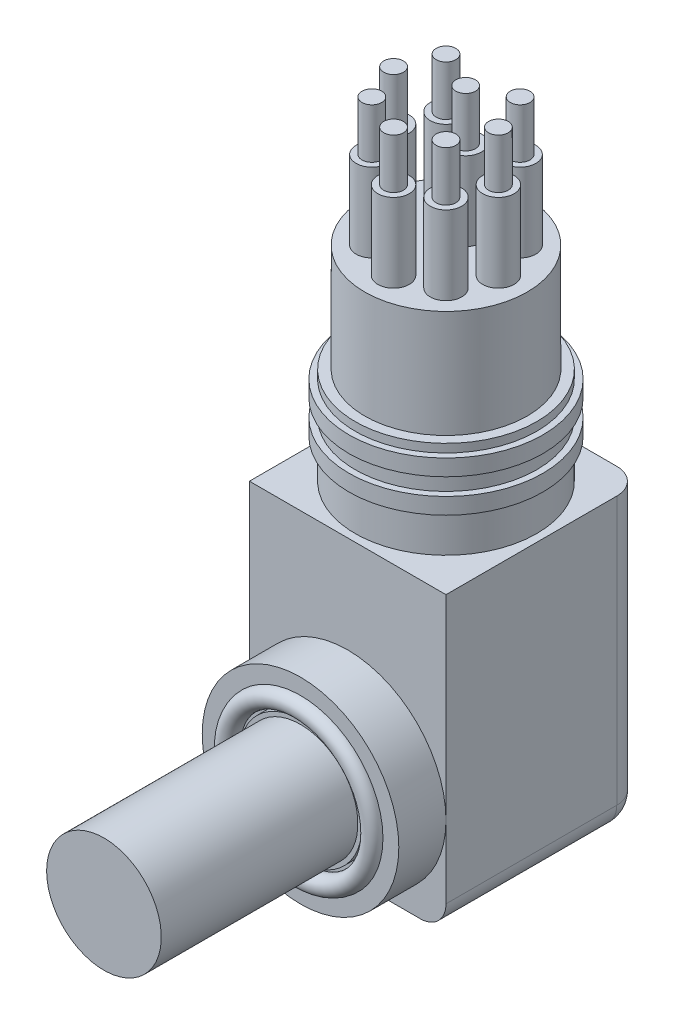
from build123d import *

# Parameters (mm, degrees)
SKETCH1_W          = 19.05
SKETCH1_H          = 19.05
EXTRUDE1_DEPTH     = 28.448
SKETCH3_R          = 7.874
EXTRUDE2_DEPTH     = 10.414
SKETCH4_R          = 1.524
EXTRUDE9_DEPTH     = 7.62
SKETCH12_R         = 0.9525
EXTRUDE10_DEPTH    = 4.826
CIRPATTERN1_COUNT  = 8
SKETCH_1_R         = 1.524
EXTRUDE11_DEPTH    = 7.62
SKETCH13_R         = 0.9525
EXTRUDE12_DEPTH    = 4.826
SKETCH10_R         = 9.525
EXTRUDE8_DEPTH     = 4.572
SKETCH11_R         = 7.9885
SKETCH11_R_2       = 5.9565
CUT_EXTRUDE1_DEPTH = 1.27
SKETCH8_R          = 5.55625
EXTRUDE7_DEPTH     = 19.05
SKETCH9_R          = 0.89
FILLET1_R          = 2.5


with BuildPart() as part:
    # Sketch1 → Extrude1 (new body)
    with BuildSketch(Plane(origin=(0, 0, 0), x_dir=(1, 0, 0), z_dir=(0, 1, 0))):
        Rectangle(SKETCH1_W, SKETCH1_H)
    extrude(amount=EXTRUDE1_DEPTH)

    # Sketch2 → Revolve1 (revolve)
    with BuildSketch(Plane.XY, mode=Mode.PRIVATE) as revolve1_sk:
        Polygon((8.8011, 28.448), (8.8011, 32.2326), (9.398, 32.2326), (9.398, 33.8074), (8.8011, 33.8074), (8.8011, 35.4584), (9.398, 35.4584), (9.398, 37.0332), (8.8011, 37.0332), (8.8011, 37.846), (0, 37.846), (0, 28.448), align=None)
    revolve(revolve1_sk.sketch.rotate(Axis((0, 0, 0), (0, -1, 0)), 180), axis=Axis((0, 0, 0), (0, -1, 0)))

    # Sketch3 → Extrude2 (add)
    with BuildSketch(Plane(origin=(0, 37.846, 0), x_dir=(-1, 0, 0), z_dir=(0, 1, 0))):
        with Locations(Location((0, 0, 0), (0, 0, 180))):
            Circle(SKETCH3_R)
    extrude(amount=EXTRUDE2_DEPTH)

    # Sketch4 → Extrude9 (add)
    with BuildSketch(Plane(origin=(0, 48.26, 0), x_dir=(-1, 0, 0), z_dir=(0, 1, 0))):
        with Locations((0, 5.08)):
            Circle(SKETCH4_R)
    extrude9 = extrude(amount=EXTRUDE9_DEPTH)

    # Sketch12 → Extrude10 (add)
    with BuildSketch(Plane(origin=(0, 55.88, 0), x_dir=(1, 0, 0), z_dir=(0, 1, 0))):
        with Locations(Location((0, -5.08, 0), (0, 0, 180))):
            Circle(SKETCH12_R)
    extrude10 = extrude(amount=EXTRUDE10_DEPTH)

    # CirPattern1: Extrude9, Extrude10 ×8 about axis, 1 skipped
    cirpattern1_axis = Axis((0, 0, 0), (0, -1, 0))
    add([extrude9.rotate(cirpattern1_axis, i * 360 / CIRPATTERN1_COUNT) for i in range(1, CIRPATTERN1_COUNT) if i not in (4,)])
    add([extrude10.rotate(cirpattern1_axis, i * 360 / CIRPATTERN1_COUNT) for i in range(1, CIRPATTERN1_COUNT) if i not in (4,)])

    # Sketch 1 → Extrude11 (add)
    with BuildSketch(Plane(origin=(0.09953018, 48.26, 4.480198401), x_dir=(-1, 0, 0), z_dir=(0, 1, 0))):
        with Locations((0.09953018, -6.385198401)):
            Circle(SKETCH_1_R)
    extrude(amount=EXTRUDE11_DEPTH)

    # Sketch13 → Extrude12 (add)
    with BuildSketch(Plane(origin=(0, 55.88, 0), x_dir=(1, 0, 0), z_dir=(0, 1, 0))):
        with Locations(Location((0, 1.905, 0), (0, 0, 180))):
            Circle(SKETCH13_R)
    extrude(amount=EXTRUDE12_DEPTH)

    # Sketch10 → Extrude8 (add)
    with BuildSketch(Plane.XY.offset(9.525)):
        with Locations((0, 9.525)):
            Circle(SKETCH10_R)
    extrude(amount=EXTRUDE8_DEPTH)

    # Sketch11 → Cut-Extrude1 (cut)
    with BuildSketch(Plane.XY.offset(14.097)):
        with Locations((0, 9.525)):
            Circle(SKETCH11_R)
        with Locations((0, 9.525)):
            Circle(SKETCH11_R_2, mode=Mode.SUBTRACT)
    extrude(amount=-CUT_EXTRUDE1_DEPTH, mode=Mode.SUBTRACT)

    # Sketch8 → Extrude7 (add)
    with BuildSketch(Plane(origin=(0, 12.8, 14.097), x_dir=(1, 0, 0), z_dir=(0, 0, -1))):
        with Locations(Location((0, 3.275, 0), (0, 0, 180))):
            Circle(SKETCH8_R)
    extrude(amount=-EXTRUDE7_DEPTH)

    # Sketch9 → o-ring 12.42x1.78 (revolve)
    with BuildSketch(Plane(origin=(0, -0.125998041, 0.125998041), x_dir=(0, 1, 0), z_dir=(1, 0, 0)), mode=Mode.PRIVATE) as o_ring_12_42x1_78_sk:
        with Locations((16.750998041, 13.971001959)):
            Circle(SKETCH9_R)
    revolve(o_ring_12_42x1_78_sk.sketch.rotate(Axis((0, 9.525, 13.263482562), (0, 0, -1)), 90), axis=Axis((0, 9.525, 13.263482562), (0, 0, -1)))

    # Fillet1
    fillet1_edges = [part.edges().sort_by_distance(p)[0] for p in [
        (0, 0, -9.525),
        (9.525, 0, 0),
        (-9.525, 0, 0),
        (-9.525, 14.224, -9.525),
        (9.525, 14.224, -9.525),
    ]]
    fillet(fillet1_edges, radius=FILLET1_R)


solid = part.part
